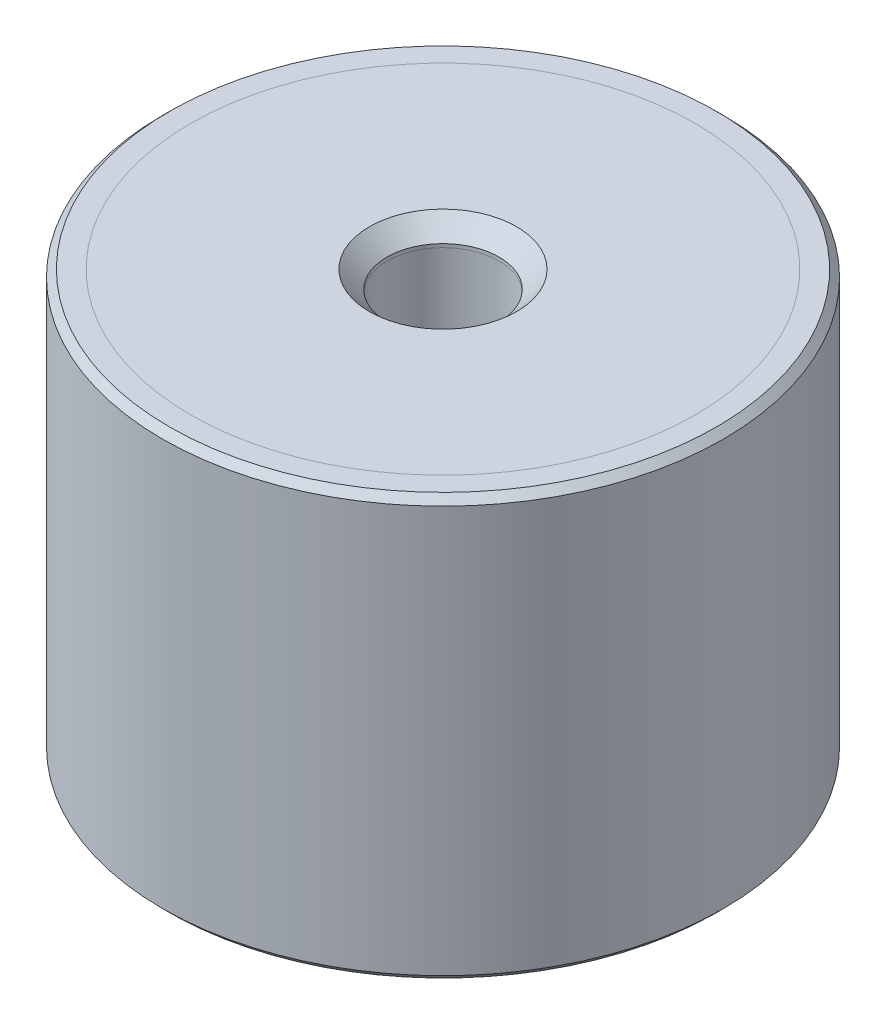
ISO-10303-21;
HEADER;
FILE_DESCRIPTION(('STEP AP214'),'2;1');
FILE_NAME('part.step','',(''),(''),'','','');
FILE_SCHEMA(('AUTOMOTIVE_DESIGN { 1 0 10303 214 1 1 1 1 }'));
ENDSEC;
DATA;
#1=APPLICATION_CONTEXT('core data for automotive mechanical design processes');
#2=APPLICATION_PROTOCOL_DEFINITION('international standard','automotive_design',2000,#1);
#3=PRODUCT_CONTEXT('',#1,'mechanical');
#4=PRODUCT('Part','Part','',(#3));
#5=PRODUCT_RELATED_PRODUCT_CATEGORY('part','',(#4));
#6=PRODUCT_DEFINITION_FORMATION('','',#4);
#7=PRODUCT_DEFINITION_CONTEXT('part definition',#1,'design');
#8=PRODUCT_DEFINITION('design','',#6,#7);
#9=PRODUCT_DEFINITION_SHAPE('','',#8);
#10=(LENGTH_UNIT() NAMED_UNIT(*) SI_UNIT(.MILLI.,.METRE.));
#11=(NAMED_UNIT(*) PLANE_ANGLE_UNIT() SI_UNIT($,.RADIAN.));
#12=(NAMED_UNIT(*) SI_UNIT($,.STERADIAN.) SOLID_ANGLE_UNIT());
#13=UNCERTAINTY_MEASURE_WITH_UNIT(LENGTH_MEASURE(1.E-05),#10,'distance_accuracy_value','');
#14=(GEOMETRIC_REPRESENTATION_CONTEXT(3) GLOBAL_UNCERTAINTY_ASSIGNED_CONTEXT((#13)) GLOBAL_UNIT_ASSIGNED_CONTEXT((#10,
#11,#12)) REPRESENTATION_CONTEXT('',''));
#15=CARTESIAN_POINT('',(0.,0.,0.));
#16=DIRECTION('',(0.,0.,1.));
#17=DIRECTION('',(1.,0.,0.));
#18=AXIS2_PLACEMENT_3D('',#15,#16,#17);
#19=CARTESIAN_POINT('',(0.,41.0340428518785,0.));
#20=DIRECTION('',(0.,1.,0.));
#21=DIRECTION('',(0.,0.,1.));
#22=AXIS2_PLACEMENT_3D('',#19,#20,#21);
#23=CYLINDRICAL_SURFACE('',#22,4.);
#24=CARTESIAN_POINT('',(0.,-27.25,0.));
#25=DIRECTION('',(0.,-1.,0.));
#26=DIRECTION('',(0.,0.,-1.));
#27=AXIS2_PLACEMENT_3D('',#24,#25,#26);
#28=CIRCLE('',#27,4.);
#29=CARTESIAN_POINT('',(0.,-27.25,-4.));
#30=VERTEX_POINT('',#29);
#31=EDGE_CURVE('P0_E10',#30,#30,#28,.T.);
#32=ORIENTED_EDGE('',*,*,#31,.T.);
#33=EDGE_LOOP('',(#32));
#34=FACE_BOUND('',#33,.T.);
#35=CARTESIAN_POINT('',(0.,-27.,0.));
#36=DIRECTION('',(0.,1.,0.));
#37=DIRECTION('',(0.,0.,1.));
#38=AXIS2_PLACEMENT_3D('',#35,#36,#37);
#39=CIRCLE('',#38,4.);
#40=CARTESIAN_POINT('',(0.,-27.,4.));
#41=VERTEX_POINT('',#40);
#42=EDGE_CURVE('P0_E25',#41,#41,#39,.T.);
#43=ORIENTED_EDGE('',*,*,#42,.T.);
#44=EDGE_LOOP('',(#43));
#45=FACE_BOUND('',#44,.T.);
#46=ADVANCED_FACE('P0_F14',(#34,#45),#23,.F.);
#47=CARTESIAN_POINT('',(0.,-27.,4.));
#48=DIRECTION('',(0.,1.,0.));
#49=DIRECTION('',(0.,0.,1.));
#50=AXIS2_PLACEMENT_3D('',#47,#48,#49);
#51=PLANE('',#50);
#52=CARTESIAN_POINT('',(0.,-27.,0.));
#53=DIRECTION('',(0.,1.,0.));
#54=DIRECTION('',(0.,0.,1.));
#55=AXIS2_PLACEMENT_3D('',#52,#53,#54);
#56=CIRCLE('',#55,18.);
#57=CARTESIAN_POINT('',(0.,-27.,18.));
#58=VERTEX_POINT('',#57);
#59=EDGE_CURVE('P0_E29',#58,#58,#56,.T.);
#60=ORIENTED_EDGE('',*,*,#59,.T.);
#61=EDGE_LOOP('',(#60));
#62=FACE_BOUND('',#61,.T.);
#63=ORIENTED_EDGE('',*,*,#42,.F.);
#64=EDGE_LOOP('',(#63));
#65=FACE_BOUND('',#64,.T.);
#66=ADVANCED_FACE('P0_F50',(#62,#65),#51,.T.);
#67=CARTESIAN_POINT('',(0.,41.0340428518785,0.));
#68=DIRECTION('',(0.,1.,0.));
#69=DIRECTION('',(0.,0.,1.));
#70=AXIS2_PLACEMENT_3D('',#67,#68,#69);
#71=CYLINDRICAL_SURFACE('',#70,18.);
#72=CARTESIAN_POINT('',(0.,-28.5,0.));
#73=DIRECTION('',(0.,1.,0.));
#74=DIRECTION('',(0.,0.,1.));
#75=AXIS2_PLACEMENT_3D('',#72,#73,#74);
#76=CIRCLE('',#75,18.);
#77=CARTESIAN_POINT('',(0.,-28.5,18.));
#78=VERTEX_POINT('',#77);
#79=EDGE_CURVE('P0_E34',#78,#78,#76,.T.);
#80=ORIENTED_EDGE('',*,*,#79,.T.);
#81=EDGE_LOOP('',(#80));
#82=FACE_BOUND('',#81,.T.);
#83=ORIENTED_EDGE('',*,*,#59,.F.);
#84=EDGE_LOOP('',(#83));
#85=FACE_BOUND('',#84,.T.);
#86=ADVANCED_FACE('P0_F38',(#82,#85),#71,.T.);
#87=CARTESIAN_POINT('',(0.,-28.5,18.));
#88=DIRECTION('',(0.,-1.,0.));
#89=DIRECTION('',(0.,0.,-1.));
#90=AXIS2_PLACEMENT_3D('',#87,#88,#89);
#91=PLANE('',#90);
#92=CARTESIAN_POINT('',(0.,-28.5,0.));
#93=DIRECTION('',(0.,-1.,0.));
#94=DIRECTION('',(0.,0.,-1.));
#95=AXIS2_PLACEMENT_3D('',#92,#93,#94);
#96=CIRCLE('',#95,5.25);
#97=CARTESIAN_POINT('',(0.,-28.5,-5.25));
#98=VERTEX_POINT('',#97);
#99=EDGE_CURVE('P0_E21',#98,#98,#96,.F.);
#100=ORIENTED_EDGE('',*,*,#99,.T.);
#101=EDGE_LOOP('',(#100));
#102=FACE_BOUND('',#101,.T.);
#103=ORIENTED_EDGE('',*,*,#79,.F.);
#104=EDGE_LOOP('',(#103));
#105=FACE_BOUND('',#104,.T.);
#106=ADVANCED_FACE('P0_F41',(#102,#105),#91,.T.);
#107=CARTESIAN_POINT('',(0.,-28.5,0.));
#108=DIRECTION('',(0.,-1.,0.));
#109=DIRECTION('',(0.,0.,-1.));
#110=AXIS2_PLACEMENT_3D('',#107,#108,#109);
#111=CONICAL_SURFACE('',#110,5.25,0.785398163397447);
#112=ORIENTED_EDGE('',*,*,#31,.F.);
#113=EDGE_LOOP('',(#112));
#114=FACE_BOUND('',#113,.T.);
#115=ORIENTED_EDGE('',*,*,#99,.F.);
#116=EDGE_LOOP('',(#115));
#117=FACE_BOUND('',#116,.T.);
#118=ADVANCED_FACE('P0_F16',(#114,#117),#111,.F.);
#119=CLOSED_SHELL('',(#46,#66,#86,#106,#118));
#120=MANIFOLD_SOLID_BREP('P0_B1',#119);
#121=CARTESIAN_POINT('',(0.,69.5340428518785,0.));
#122=DIRECTION('',(0.,1.,0.));
#123=DIRECTION('',(0.,0.,1.));
#124=AXIS2_PLACEMENT_3D('',#121,#122,#123);
#125=CYLINDRICAL_SURFACE('',#124,4.);
#126=CARTESIAN_POINT('',(0.,0.249999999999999,0.));
#127=DIRECTION('',(0.,1.,0.));
#128=DIRECTION('',(0.,0.,1.));
#129=AXIS2_PLACEMENT_3D('',#126,#127,#128);
#130=CIRCLE('',#129,4.);
#131=CARTESIAN_POINT('',(0.,0.249999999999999,4.));
#132=VERTEX_POINT('',#131);
#133=EDGE_CURVE('P1_E21',#132,#132,#130,.T.);
#134=ORIENTED_EDGE('',*,*,#133,.T.);
#135=EDGE_LOOP('',(#134));
#136=FACE_BOUND('',#135,.T.);
#137=CARTESIAN_POINT('',(0.,0.,0.));
#138=DIRECTION('',(0.,1.,0.));
#139=DIRECTION('',(0.,0.,1.));
#140=AXIS2_PLACEMENT_3D('',#137,#138,#139);
#141=CIRCLE('',#140,4.);
#142=CARTESIAN_POINT('',(0.,0.,4.));
#143=VERTEX_POINT('',#142);
#144=EDGE_CURVE('P1_E34',#143,#143,#141,.T.);
#145=ORIENTED_EDGE('',*,*,#144,.F.);
#146=EDGE_LOOP('',(#145));
#147=FACE_BOUND('',#146,.T.);
#148=ADVANCED_FACE('P1_F14',(#136,#147),#125,.F.);
#149=CARTESIAN_POINT('',(0.,1.5,4.));
#150=DIRECTION('',(0.,1.,0.));
#151=DIRECTION('',(0.,0.,1.));
#152=AXIS2_PLACEMENT_3D('',#149,#150,#151);
#153=PLANE('',#152);
#154=CARTESIAN_POINT('',(0.,1.5,0.));
#155=DIRECTION('',(0.,1.,0.));
#156=DIRECTION('',(0.,0.,1.));
#157=AXIS2_PLACEMENT_3D('',#154,#155,#156);
#158=CIRCLE('',#157,5.25);
#159=CARTESIAN_POINT('',(0.,1.5,5.25));
#160=VERTEX_POINT('',#159);
#161=EDGE_CURVE('P1_E10',#160,#160,#158,.F.);
#162=ORIENTED_EDGE('',*,*,#161,.T.);
#163=EDGE_LOOP('',(#162));
#164=FACE_BOUND('',#163,.T.);
#165=CARTESIAN_POINT('',(0.,1.5,0.));
#166=DIRECTION('',(0.,1.,0.));
#167=DIRECTION('',(0.,0.,1.));
#168=AXIS2_PLACEMENT_3D('',#165,#166,#167);
#169=CIRCLE('',#168,18.);
#170=CARTESIAN_POINT('',(0.,1.5,18.));
#171=VERTEX_POINT('',#170);
#172=EDGE_CURVE('P1_E25',#171,#171,#169,.T.);
#173=ORIENTED_EDGE('',*,*,#172,.T.);
#174=EDGE_LOOP('',(#173));
#175=FACE_BOUND('',#174,.T.);
#176=ADVANCED_FACE('P1_F42',(#164,#175),#153,.T.);
#177=CARTESIAN_POINT('',(0.,69.5340428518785,0.));
#178=DIRECTION('',(0.,1.,0.));
#179=DIRECTION('',(0.,0.,1.));
#180=AXIS2_PLACEMENT_3D('',#177,#178,#179);
#181=CYLINDRICAL_SURFACE('',#180,18.);
#182=CARTESIAN_POINT('',(0.,0.,0.));
#183=DIRECTION('',(0.,1.,0.));
#184=DIRECTION('',(0.,0.,1.));
#185=AXIS2_PLACEMENT_3D('',#182,#183,#184);
#186=CIRCLE('',#185,18.);
#187=CARTESIAN_POINT('',(0.,0.,18.));
#188=VERTEX_POINT('',#187);
#189=EDGE_CURVE('P1_E29',#188,#188,#186,.T.);
#190=ORIENTED_EDGE('',*,*,#189,.T.);
#191=EDGE_LOOP('',(#190));
#192=FACE_BOUND('',#191,.T.);
#193=ORIENTED_EDGE('',*,*,#172,.F.);
#194=EDGE_LOOP('',(#193));
#195=FACE_BOUND('',#194,.T.);
#196=ADVANCED_FACE('P1_F47',(#192,#195),#181,.T.);
#197=CARTESIAN_POINT('',(0.,0.,18.));
#198=DIRECTION('',(0.,-1.,0.));
#199=DIRECTION('',(0.,0.,-1.));
#200=AXIS2_PLACEMENT_3D('',#197,#198,#199);
#201=PLANE('',#200);
#202=ORIENTED_EDGE('',*,*,#144,.T.);
#203=EDGE_LOOP('',(#202));
#204=FACE_BOUND('',#203,.T.);
#205=ORIENTED_EDGE('',*,*,#189,.F.);
#206=EDGE_LOOP('',(#205));
#207=FACE_BOUND('',#206,.T.);
#208=ADVANCED_FACE('P1_F38',(#204,#207),#201,.T.);
#209=CARTESIAN_POINT('',(0.,0.249999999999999,0.));
#210=DIRECTION('',(0.,1.,0.));
#211=DIRECTION('',(0.,0.,1.));
#212=AXIS2_PLACEMENT_3D('',#209,#210,#211);
#213=CONICAL_SURFACE('',#212,4.,0.78539816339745);
#214=ORIENTED_EDGE('',*,*,#161,.F.);
#215=EDGE_LOOP('',(#214));
#216=FACE_BOUND('',#215,.T.);
#217=ORIENTED_EDGE('',*,*,#133,.F.);
#218=EDGE_LOOP('',(#217));
#219=FACE_BOUND('',#218,.T.);
#220=ADVANCED_FACE('P1_F16',(#216,#219),#213,.F.);
#221=CLOSED_SHELL('',(#148,#176,#196,#208,#220));
#222=MANIFOLD_SOLID_BREP('P1_B1',#221);
#223=CARTESIAN_POINT('',(0.,0.,0.));
#224=DIRECTION('',(0.,1.,0.));
#225=DIRECTION('',(0.,0.,1.));
#226=AXIS2_PLACEMENT_3D('',#223,#224,#225);
#227=PLANE('',#226);
#228=CARTESIAN_POINT('',(0.,0.,0.));
#229=DIRECTION('',(0.,1.,0.));
#230=DIRECTION('',(0.,0.,1.));
#231=AXIS2_PLACEMENT_3D('',#228,#229,#230);
#232=CIRCLE('',#231,4.);
#233=CARTESIAN_POINT('',(0.,0.,4.));
#234=VERTEX_POINT('',#233);
#235=EDGE_CURVE('P2_E46',#234,#234,#232,.T.);
#236=ORIENTED_EDGE('',*,*,#235,.F.);
#237=EDGE_LOOP('',(#236));
#238=FACE_BOUND('',#237,.T.);
#239=CARTESIAN_POINT('',(0.,0.,0.));
#240=DIRECTION('',(0.,1.,0.));
#241=DIRECTION('',(0.,0.,1.));
#242=AXIS2_PLACEMENT_3D('',#239,#240,#241);
#243=CIRCLE('',#242,18.);
#244=CARTESIAN_POINT('',(0.,0.,18.));
#245=VERTEX_POINT('',#244);
#246=EDGE_CURVE('P2_E33',#245,#245,#243,.T.);
#247=ORIENTED_EDGE('',*,*,#246,.T.);
#248=EDGE_LOOP('',(#247));
#249=FACE_BOUND('',#248,.T.);
#250=ADVANCED_FACE('P2_F13',(#238,#249),#227,.T.);
#251=CARTESIAN_POINT('',(0.,65.5134936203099,0.));
#252=DIRECTION('',(0.,1.,0.));
#253=DIRECTION('',(0.,0.,1.));
#254=AXIS2_PLACEMENT_3D('',#251,#252,#253);
#255=CYLINDRICAL_SURFACE('',#254,18.);
#256=CARTESIAN_POINT('',(0.,1.5,0.));
#257=DIRECTION('',(0.,1.,0.));
#258=DIRECTION('',(0.,0.,1.));
#259=AXIS2_PLACEMENT_3D('',#256,#257,#258);
#260=CIRCLE('',#259,18.);
#261=CARTESIAN_POINT('',(0.,1.5,18.));
#262=VERTEX_POINT('',#261);
#263=EDGE_CURVE('P2_E36',#262,#262,#260,.T.);
#264=ORIENTED_EDGE('',*,*,#263,.T.);
#265=EDGE_LOOP('',(#264));
#266=FACE_BOUND('',#265,.T.);
#267=ORIENTED_EDGE('',*,*,#246,.F.);
#268=EDGE_LOOP('',(#267));
#269=FACE_BOUND('',#268,.T.);
#270=ADVANCED_FACE('P2_F92',(#266,#269),#255,.F.);
#271=CARTESIAN_POINT('',(0.,1.5,18.));
#272=DIRECTION('',(0.,1.,0.));
#273=DIRECTION('',(0.,0.,1.));
#274=AXIS2_PLACEMENT_3D('',#271,#272,#273);
#275=PLANE('',#274);
#276=CARTESIAN_POINT('',(0.,1.5,0.));
#277=DIRECTION('',(0.,1.,0.));
#278=DIRECTION('',(0.,0.,1.));
#279=AXIS2_PLACEMENT_3D('',#276,#277,#278);
#280=CIRCLE('',#279,19.5);
#281=CARTESIAN_POINT('',(0.,1.5,19.5));
#282=VERTEX_POINT('',#281);
#283=EDGE_CURVE('P2_E9',#282,#282,#280,.T.);
#284=ORIENTED_EDGE('',*,*,#283,.T.);
#285=EDGE_LOOP('',(#284));
#286=FACE_BOUND('',#285,.T.);
#287=ORIENTED_EDGE('',*,*,#263,.F.);
#288=EDGE_LOOP('',(#287));
#289=FACE_BOUND('',#288,.T.);
#290=ADVANCED_FACE('P2_F88',(#286,#289),#275,.T.);
#291=CARTESIAN_POINT('',(0.,65.5134936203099,0.));
#292=DIRECTION('',(0.,1.,0.));
#293=DIRECTION('',(0.,0.,1.));
#294=AXIS2_PLACEMENT_3D('',#291,#292,#293);
#295=CYLINDRICAL_SURFACE('',#294,20.);
#296=CARTESIAN_POINT('',(0.,-28.,0.));
#297=DIRECTION('',(0.,-1.,0.));
#298=DIRECTION('',(0.,0.,-1.));
#299=AXIS2_PLACEMENT_3D('',#296,#297,#298);
#300=CIRCLE('',#299,20.);
#301=CARTESIAN_POINT('',(0.,-28.,-20.));
#302=VERTEX_POINT('',#301);
#303=EDGE_CURVE('P2_E24',#302,#302,#300,.F.);
#304=ORIENTED_EDGE('',*,*,#303,.T.);
#305=EDGE_LOOP('',(#304));
#306=FACE_BOUND('',#305,.T.);
#307=CARTESIAN_POINT('',(0.,1.00000000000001,0.));
#308=DIRECTION('',(0.,1.,0.));
#309=DIRECTION('',(0.,0.,1.));
#310=AXIS2_PLACEMENT_3D('',#307,#308,#309);
#311=CIRCLE('',#310,20.);
#312=CARTESIAN_POINT('',(0.,1.00000000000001,20.));
#313=VERTEX_POINT('',#312);
#314=EDGE_CURVE('P2_E28',#313,#313,#311,.F.);
#315=ORIENTED_EDGE('',*,*,#314,.T.);
#316=EDGE_LOOP('',(#315));
#317=FACE_BOUND('',#316,.T.);
#318=ADVANCED_FACE('P2_F82',(#306,#317),#295,.T.);
#319=CARTESIAN_POINT('',(0.,-28.5,20.));
#320=DIRECTION('',(0.,-1.,0.));
#321=DIRECTION('',(0.,0.,-1.));
#322=AXIS2_PLACEMENT_3D('',#319,#320,#321);
#323=PLANE('',#322);
#324=CARTESIAN_POINT('',(0.,-28.5,0.));
#325=DIRECTION('',(0.,-1.,0.));
#326=DIRECTION('',(0.,0.,-1.));
#327=AXIS2_PLACEMENT_3D('',#324,#325,#326);
#328=CIRCLE('',#327,19.5);
#329=CARTESIAN_POINT('',(0.,-28.5,-19.5));
#330=VERTEX_POINT('',#329);
#331=EDGE_CURVE('P2_E20',#330,#330,#328,.T.);
#332=ORIENTED_EDGE('',*,*,#331,.T.);
#333=EDGE_LOOP('',(#332));
#334=FACE_BOUND('',#333,.T.);
#335=CARTESIAN_POINT('',(0.,-28.5,0.));
#336=DIRECTION('',(0.,1.,0.));
#337=DIRECTION('',(0.,0.,1.));
#338=AXIS2_PLACEMENT_3D('',#335,#336,#337);
#339=CIRCLE('',#338,18.);
#340=CARTESIAN_POINT('',(0.,-28.5,18.));
#341=VERTEX_POINT('',#340);
#342=EDGE_CURVE('P2_E39',#341,#341,#339,.T.);
#343=ORIENTED_EDGE('',*,*,#342,.T.);
#344=EDGE_LOOP('',(#343));
#345=FACE_BOUND('',#344,.T.);
#346=ADVANCED_FACE('P2_F77',(#334,#345),#323,.T.);
#347=CARTESIAN_POINT('',(0.,65.5134936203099,0.));
#348=DIRECTION('',(0.,1.,0.));
#349=DIRECTION('',(0.,0.,1.));
#350=AXIS2_PLACEMENT_3D('',#347,#348,#349);
#351=CYLINDRICAL_SURFACE('',#350,18.);
#352=CARTESIAN_POINT('',(0.,-27.,0.));
#353=DIRECTION('',(0.,1.,0.));
#354=DIRECTION('',(0.,0.,1.));
#355=AXIS2_PLACEMENT_3D('',#352,#353,#354);
#356=CIRCLE('',#355,18.);
#357=CARTESIAN_POINT('',(0.,-27.,18.));
#358=VERTEX_POINT('',#357);
#359=EDGE_CURVE('P2_E42',#358,#358,#356,.T.);
#360=ORIENTED_EDGE('',*,*,#359,.T.);
#361=EDGE_LOOP('',(#360));
#362=FACE_BOUND('',#361,.T.);
#363=ORIENTED_EDGE('',*,*,#342,.F.);
#364=EDGE_LOOP('',(#363));
#365=FACE_BOUND('',#364,.T.);
#366=ADVANCED_FACE('P2_F71',(#362,#365),#351,.F.);
#367=CARTESIAN_POINT('',(0.,-27.,18.));
#368=DIRECTION('',(0.,-1.,0.));
#369=DIRECTION('',(0.,0.,-1.));
#370=AXIS2_PLACEMENT_3D('',#367,#368,#369);
#371=PLANE('',#370);
#372=CARTESIAN_POINT('',(0.,-27.,0.));
#373=DIRECTION('',(0.,-1.,0.));
#374=DIRECTION('',(0.,0.,-1.));
#375=AXIS2_PLACEMENT_3D('',#372,#373,#374);
#376=CIRCLE('',#375,4.);
#377=CARTESIAN_POINT('',(0.,-27.,-4.));
#378=VERTEX_POINT('',#377);
#379=EDGE_CURVE('P2_E52',#378,#378,#376,.T.);
#380=ORIENTED_EDGE('',*,*,#379,.F.);
#381=EDGE_LOOP('',(#380));
#382=FACE_BOUND('',#381,.T.);
#383=ORIENTED_EDGE('',*,*,#359,.F.);
#384=EDGE_LOOP('',(#383));
#385=FACE_BOUND('',#384,.T.);
#386=ADVANCED_FACE('P2_F67',(#382,#385),#371,.T.);
#387=CARTESIAN_POINT('',(0.,-28.,0.));
#388=DIRECTION('',(0.,1.,0.));
#389=DIRECTION('',(0.,0.,1.));
#390=AXIS2_PLACEMENT_3D('',#387,#388,#389);
#391=CONICAL_SURFACE('',#390,20.,0.785398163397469);
#392=ORIENTED_EDGE('',*,*,#331,.F.);
#393=EDGE_LOOP('',(#392));
#394=FACE_BOUND('',#393,.T.);
#395=ORIENTED_EDGE('',*,*,#303,.F.);
#396=EDGE_LOOP('',(#395));
#397=FACE_BOUND('',#396,.T.);
#398=ADVANCED_FACE('P2_F70',(#394,#397),#391,.T.);
#399=CARTESIAN_POINT('',(0.,1.5,0.));
#400=DIRECTION('',(0.,-1.,0.));
#401=DIRECTION('',(0.,0.,-1.));
#402=AXIS2_PLACEMENT_3D('',#399,#400,#401);
#403=CONICAL_SURFACE('',#402,19.5,0.785398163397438);
#404=ORIENTED_EDGE('',*,*,#314,.F.);
#405=EDGE_LOOP('',(#404));
#406=FACE_BOUND('',#405,.T.);
#407=ORIENTED_EDGE('',*,*,#283,.F.);
#408=EDGE_LOOP('',(#407));
#409=FACE_BOUND('',#408,.T.);
#410=ADVANCED_FACE('P2_F15',(#406,#409),#403,.T.);
#411=CARTESIAN_POINT('',(0.,-6.5,0.));
#412=DIRECTION('',(0.,1.,0.));
#413=DIRECTION('',(0.,0.,1.));
#414=AXIS2_PLACEMENT_3D('',#411,#412,#413);
#415=CYLINDRICAL_SURFACE('',#414,4.);
#416=CARTESIAN_POINT('',(0.,-6.5,0.));
#417=DIRECTION('',(0.,1.,0.));
#418=DIRECTION('',(0.,0.,1.));
#419=AXIS2_PLACEMENT_3D('',#416,#417,#418);
#420=CIRCLE('',#419,4.);
#421=CARTESIAN_POINT('',(0.,-6.5,4.));
#422=VERTEX_POINT('',#421);
#423=EDGE_CURVE('P2_E45',#422,#422,#420,.T.);
#424=CARTESIAN_POINT('',(0.,-6.5,4.));
#425=CARTESIAN_POINT('',(0.,-6.43229166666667,4.));
#426=CARTESIAN_POINT('',(0.,-6.36458333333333,4.));
#427=CARTESIAN_POINT('',(0.,-6.22916666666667,4.));
#428=CARTESIAN_POINT('',(0.,-6.16145833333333,4.));
#429=CARTESIAN_POINT('',(0.,-6.02604166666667,4.));
#430=CARTESIAN_POINT('',(0.,-5.95833333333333,4.));
#431=CARTESIAN_POINT('',(0.,-5.82291666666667,4.));
#432=CARTESIAN_POINT('',(0.,-5.75520833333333,4.));
#433=CARTESIAN_POINT('',(0.,-5.61979166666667,4.));
#434=CARTESIAN_POINT('',(0.,-5.55208333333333,4.));
#435=CARTESIAN_POINT('',(0.,-5.41666666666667,4.));
#436=CARTESIAN_POINT('',(0.,-5.34895833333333,4.));
#437=CARTESIAN_POINT('',(0.,-5.21354166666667,4.));
#438=CARTESIAN_POINT('',(0.,-5.14583333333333,4.));
#439=CARTESIAN_POINT('',(0.,-5.01041666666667,4.));
#440=CARTESIAN_POINT('',(0.,-4.94270833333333,4.));
#441=CARTESIAN_POINT('',(0.,-4.80729166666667,4.));
#442=CARTESIAN_POINT('',(0.,-4.73958333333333,4.));
#443=CARTESIAN_POINT('',(0.,-4.60416666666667,4.));
#444=CARTESIAN_POINT('',(0.,-4.53645833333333,4.));
#445=CARTESIAN_POINT('',(0.,-4.40104166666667,4.));
#446=CARTESIAN_POINT('',(0.,-4.33333333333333,4.));
#447=CARTESIAN_POINT('',(0.,-4.19791666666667,4.));
#448=CARTESIAN_POINT('',(0.,-4.13020833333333,4.));
#449=CARTESIAN_POINT('',(0.,-3.99479166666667,4.));
#450=CARTESIAN_POINT('',(0.,-3.92708333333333,4.));
#451=CARTESIAN_POINT('',(0.,-3.79166666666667,4.));
#452=CARTESIAN_POINT('',(0.,-3.72395833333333,4.));
#453=CARTESIAN_POINT('',(0.,-3.58854166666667,4.));
#454=CARTESIAN_POINT('',(0.,-3.52083333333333,4.));
#455=CARTESIAN_POINT('',(0.,-3.38541666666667,4.));
#456=CARTESIAN_POINT('',(0.,-3.31770833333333,4.));
#457=CARTESIAN_POINT('',(0.,-3.18229166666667,4.));
#458=CARTESIAN_POINT('',(0.,-3.11458333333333,4.));
#459=CARTESIAN_POINT('',(0.,-2.97916666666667,4.));
#460=CARTESIAN_POINT('',(0.,-2.91145833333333,4.));
#461=CARTESIAN_POINT('',(0.,-2.77604166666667,4.));
#462=CARTESIAN_POINT('',(0.,-2.70833333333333,4.));
#463=CARTESIAN_POINT('',(0.,-2.57291666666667,4.));
#464=CARTESIAN_POINT('',(0.,-2.50520833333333,4.));
#465=CARTESIAN_POINT('',(0.,-2.36979166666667,4.));
#466=CARTESIAN_POINT('',(0.,-2.30208333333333,4.));
#467=CARTESIAN_POINT('',(0.,-2.16666666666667,4.));
#468=CARTESIAN_POINT('',(0.,-2.09895833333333,4.));
#469=CARTESIAN_POINT('',(0.,-1.96354166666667,4.));
#470=CARTESIAN_POINT('',(0.,-1.89583333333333,4.));
#471=CARTESIAN_POINT('',(0.,-1.76041666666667,4.));
#472=CARTESIAN_POINT('',(0.,-1.69270833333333,4.));
#473=CARTESIAN_POINT('',(0.,-1.55729166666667,4.));
#474=CARTESIAN_POINT('',(0.,-1.48958333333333,4.));
#475=CARTESIAN_POINT('',(0.,-1.35416666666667,4.));
#476=CARTESIAN_POINT('',(0.,-1.28645833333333,4.));
#477=CARTESIAN_POINT('',(0.,-1.15104166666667,4.));
#478=CARTESIAN_POINT('',(0.,-1.08333333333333,4.));
#479=CARTESIAN_POINT('',(0.,-0.947916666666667,4.));
#480=CARTESIAN_POINT('',(0.,-0.880208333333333,4.));
#481=CARTESIAN_POINT('',(0.,-0.744791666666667,4.));
#482=CARTESIAN_POINT('',(0.,-0.677083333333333,4.));
#483=CARTESIAN_POINT('',(0.,-0.541666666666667,4.));
#484=CARTESIAN_POINT('',(0.,-0.473958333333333,4.));
#485=CARTESIAN_POINT('',(0.,-0.338541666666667,4.));
#486=CARTESIAN_POINT('',(0.,-0.270833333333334,4.));
#487=CARTESIAN_POINT('',(0.,-0.135416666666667,4.));
#488=CARTESIAN_POINT('',(0.,-0.0677083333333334,4.));
#489=CARTESIAN_POINT('',(0.,0.,4.));
#490=B_SPLINE_CURVE_WITH_KNOTS('',3,(#424,#425,#426,#427,#428,#429,#430,#431,#432,#433,#434,
#435,#436,#437,#438,#439,#440,#441,#442,#443,#444,#445,#446,#447,#448,#449,#450,#451,#452,#453,
#454,#455,#456,#457,#458,#459,#460,#461,#462,#463,#464,#465,#466,#467,#468,#469,#470,#471,#472,
#473,#474,#475,#476,#477,#478,#479,#480,#481,#482,#483,#484,#485,#486,#487,#488,#489),
.UNSPECIFIED.,.F.,.F.,(4,2,2,2,2,2,2,2,2,2,2,2,2,2,2,2,2,2,2,2,2,2,2,2,2,2,2,2,2,2,2,2,4),(0.,
0.203124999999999,0.40625,0.609375,0.8125,1.015625,1.21875,1.421875,1.625,1.828125,2.03125,
2.234375,2.4375,2.640625,2.84375,3.046875,3.25,3.453125,3.65625,3.859375,4.0625,4.265625,
4.46875,4.671875,4.875,5.078125,5.28125,5.484375,5.6875,5.890625,6.09375,6.296875,6.5),.UNSPECIFIED.);
#491=EDGE_CURVE('P2_BSEAM108',#422,#234,#490,.T.);
#492=ORIENTED_EDGE('',*,*,#423,.F.);
#493=ORIENTED_EDGE('',*,*,#235,.T.);
#494=ORIENTED_EDGE('',*,*,#491,.T.);
#495=ORIENTED_EDGE('',*,*,#491,.F.);
#496=EDGE_LOOP('',(#492,#494,#493,#495));
#497=FACE_BOUND('',#496,.T.);
#498=ADVANCED_FACE('P2_F108',(#497),#415,.F.);
#499=CARTESIAN_POINT('',(0.,-6.5,0.));
#500=DIRECTION('',(0.,1.,0.));
#501=DIRECTION('',(0.,0.,1.));
#502=AXIS2_PLACEMENT_3D('',#499,#500,#501);
#503=PLANE('',#502);
#504=ORIENTED_EDGE('',*,*,#423,.T.);
#505=EDGE_LOOP('',(#504));
#506=FACE_BOUND('',#505,.T.);
#507=ADVANCED_FACE('P2_F63',(#506),#503,.T.);
#508=CARTESIAN_POINT('',(0.,-20.5,0.));
#509=DIRECTION('',(0.,-1.,0.));
#510=DIRECTION('',(0.,0.,-1.));
#511=AXIS2_PLACEMENT_3D('',#508,#509,#510);
#512=CYLINDRICAL_SURFACE('',#511,4.);
#513=CARTESIAN_POINT('',(0.,-20.5,0.));
#514=DIRECTION('',(0.,-1.,0.));
#515=DIRECTION('',(0.,0.,-1.));
#516=AXIS2_PLACEMENT_3D('',#513,#514,#515);
#517=CIRCLE('',#516,4.);
#518=CARTESIAN_POINT('',(0.,-20.5,-4.));
#519=VERTEX_POINT('',#518);
#520=EDGE_CURVE('P2_E49',#519,#519,#517,.T.);
#521=CARTESIAN_POINT('',(0.,-20.5,-4.));
#522=CARTESIAN_POINT('',(0.,-20.5677083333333,-4.));
#523=CARTESIAN_POINT('',(0.,-20.6354166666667,-4.));
#524=CARTESIAN_POINT('',(0.,-20.7708333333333,-4.));
#525=CARTESIAN_POINT('',(0.,-20.8385416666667,-4.));
#526=CARTESIAN_POINT('',(0.,-20.9739583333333,-4.));
#527=CARTESIAN_POINT('',(0.,-21.0416666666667,-4.));
#528=CARTESIAN_POINT('',(0.,-21.1770833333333,-4.));
#529=CARTESIAN_POINT('',(0.,-21.2447916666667,-4.));
#530=CARTESIAN_POINT('',(0.,-21.3802083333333,-4.));
#531=CARTESIAN_POINT('',(0.,-21.4479166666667,-4.));
#532=CARTESIAN_POINT('',(0.,-21.5833333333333,-4.));
#533=CARTESIAN_POINT('',(0.,-21.6510416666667,-4.));
#534=CARTESIAN_POINT('',(0.,-21.7864583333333,-4.));
#535=CARTESIAN_POINT('',(0.,-21.8541666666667,-4.));
#536=CARTESIAN_POINT('',(0.,-21.9895833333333,-4.));
#537=CARTESIAN_POINT('',(0.,-22.0572916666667,-4.));
#538=CARTESIAN_POINT('',(0.,-22.1927083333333,-4.));
#539=CARTESIAN_POINT('',(0.,-22.2604166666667,-4.));
#540=CARTESIAN_POINT('',(0.,-22.3958333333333,-4.));
#541=CARTESIAN_POINT('',(0.,-22.4635416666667,-4.));
#542=CARTESIAN_POINT('',(0.,-22.5989583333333,-4.));
#543=CARTESIAN_POINT('',(0.,-22.6666666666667,-4.));
#544=CARTESIAN_POINT('',(0.,-22.8020833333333,-4.));
#545=CARTESIAN_POINT('',(0.,-22.8697916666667,-4.));
#546=CARTESIAN_POINT('',(0.,-23.0052083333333,-4.));
#547=CARTESIAN_POINT('',(0.,-23.0729166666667,-4.));
#548=CARTESIAN_POINT('',(0.,-23.2083333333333,-4.));
#549=CARTESIAN_POINT('',(0.,-23.2760416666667,-4.));
#550=CARTESIAN_POINT('',(0.,-23.4114583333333,-4.));
#551=CARTESIAN_POINT('',(0.,-23.4791666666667,-4.));
#552=CARTESIAN_POINT('',(0.,-23.6145833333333,-4.));
#553=CARTESIAN_POINT('',(0.,-23.6822916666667,-4.));
#554=CARTESIAN_POINT('',(0.,-23.8177083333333,-4.));
#555=CARTESIAN_POINT('',(0.,-23.8854166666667,-4.));
#556=CARTESIAN_POINT('',(0.,-24.0208333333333,-4.));
#557=CARTESIAN_POINT('',(0.,-24.0885416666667,-4.));
#558=CARTESIAN_POINT('',(0.,-24.2239583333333,-4.));
#559=CARTESIAN_POINT('',(0.,-24.2916666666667,-4.));
#560=CARTESIAN_POINT('',(0.,-24.4270833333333,-4.));
#561=CARTESIAN_POINT('',(0.,-24.4947916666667,-4.));
#562=CARTESIAN_POINT('',(0.,-24.6302083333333,-4.));
#563=CARTESIAN_POINT('',(0.,-24.6979166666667,-4.));
#564=CARTESIAN_POINT('',(0.,-24.8333333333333,-4.));
#565=CARTESIAN_POINT('',(0.,-24.9010416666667,-4.));
#566=CARTESIAN_POINT('',(0.,-25.0364583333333,-4.));
#567=CARTESIAN_POINT('',(0.,-25.1041666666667,-4.));
#568=CARTESIAN_POINT('',(0.,-25.2395833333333,-4.));
#569=CARTESIAN_POINT('',(0.,-25.3072916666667,-4.));
#570=CARTESIAN_POINT('',(0.,-25.4427083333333,-4.));
#571=CARTESIAN_POINT('',(0.,-25.5104166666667,-4.));
#572=CARTESIAN_POINT('',(0.,-25.6458333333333,-4.));
#573=CARTESIAN_POINT('',(0.,-25.7135416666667,-4.));
#574=CARTESIAN_POINT('',(0.,-25.8489583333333,-4.));
#575=CARTESIAN_POINT('',(0.,-25.9166666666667,-4.));
#576=CARTESIAN_POINT('',(0.,-26.0520833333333,-4.));
#577=CARTESIAN_POINT('',(0.,-26.1197916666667,-4.));
#578=CARTESIAN_POINT('',(0.,-26.2552083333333,-4.));
#579=CARTESIAN_POINT('',(0.,-26.3229166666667,-4.));
#580=CARTESIAN_POINT('',(0.,-26.4583333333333,-4.));
#581=CARTESIAN_POINT('',(0.,-26.5260416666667,-4.));
#582=CARTESIAN_POINT('',(0.,-26.6614583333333,-4.));
#583=CARTESIAN_POINT('',(0.,-26.7291666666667,-4.));
#584=CARTESIAN_POINT('',(0.,-26.8645833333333,-4.));
#585=CARTESIAN_POINT('',(0.,-26.9322916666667,-4.));
#586=CARTESIAN_POINT('',(0.,-27.,-4.));
#587=B_SPLINE_CURVE_WITH_KNOTS('',3,(#521,#522,#523,#524,#525,#526,#527,#528,#529,#530,#531,
#532,#533,#534,#535,#536,#537,#538,#539,#540,#541,#542,#543,#544,#545,#546,#547,#548,#549,#550,
#551,#552,#553,#554,#555,#556,#557,#558,#559,#560,#561,#562,#563,#564,#565,#566,#567,#568,#569,
#570,#571,#572,#573,#574,#575,#576,#577,#578,#579,#580,#581,#582,#583,#584,#585,#586),
.UNSPECIFIED.,.F.,.F.,(4,2,2,2,2,2,2,2,2,2,2,2,2,2,2,2,2,2,2,2,2,2,2,2,2,2,2,2,2,2,2,2,4),(0.,
0.203124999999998,0.406249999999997,0.609374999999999,0.812499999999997,1.015625,1.21875,
1.421875,1.625,1.828125,2.03125,2.234375,2.4375,2.640625,2.84375,3.046875,3.25,3.453125,3.65625,
3.859375,4.0625,4.26562499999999,4.46875,4.671875,4.875,5.078125,5.28125,5.484375,5.6875,
5.890625,6.09374999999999,6.296875,6.5),.UNSPECIFIED.);
#588=EDGE_CURVE('P2_BSEAM60',#519,#378,#587,.T.);
#589=ORIENTED_EDGE('',*,*,#520,.F.);
#590=ORIENTED_EDGE('',*,*,#379,.T.);
#591=ORIENTED_EDGE('',*,*,#588,.T.);
#592=ORIENTED_EDGE('',*,*,#588,.F.);
#593=EDGE_LOOP('',(#589,#591,#590,#592));
#594=FACE_BOUND('',#593,.T.);
#595=ADVANCED_FACE('P2_F60',(#594),#512,.F.);
#596=CARTESIAN_POINT('',(0.,-20.5,0.));
#597=DIRECTION('',(0.,-1.,0.));
#598=DIRECTION('',(0.,0.,-1.));
#599=AXIS2_PLACEMENT_3D('',#596,#597,#598);
#600=PLANE('',#599);
#601=ORIENTED_EDGE('',*,*,#520,.T.);
#602=EDGE_LOOP('',(#601));
#603=FACE_BOUND('',#602,.T.);
#604=ADVANCED_FACE('P2_F58',(#603),#600,.T.);
#605=CLOSED_SHELL('',(#250,#270,#290,#318,#346,#366,#386,#398,#410,#498,#507,#595,#604));
#606=MANIFOLD_SOLID_BREP('P2_B1',#605);
#607=ADVANCED_BREP_SHAPE_REPRESENTATION('',(#18,#120,#222,#606),#14);
#608=SHAPE_DEFINITION_REPRESENTATION(#9,#607);
ENDSEC;
END-ISO-10303-21;
